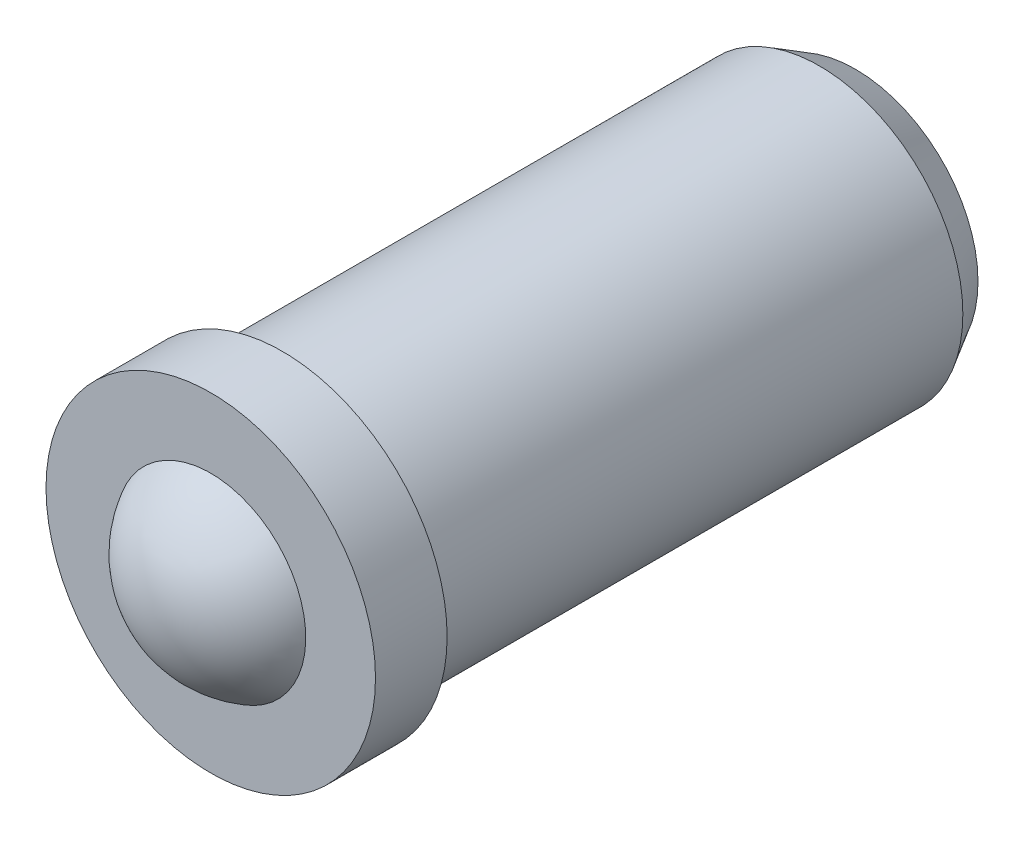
ISO-10303-21;
HEADER;
FILE_DESCRIPTION(('STEP AP214'),'2;1');
FILE_NAME('part.step','',(''),(''),'','','');
FILE_SCHEMA(('AUTOMOTIVE_DESIGN { 1 0 10303 214 1 1 1 1 }'));
ENDSEC;
DATA;
#1=APPLICATION_CONTEXT('core data for automotive mechanical design processes');
#2=APPLICATION_PROTOCOL_DEFINITION('international standard','automotive_design',2000,#1);
#3=PRODUCT_CONTEXT('',#1,'mechanical');
#4=PRODUCT('Part','Part','',(#3));
#5=PRODUCT_RELATED_PRODUCT_CATEGORY('part','',(#4));
#6=PRODUCT_DEFINITION_FORMATION('','',#4);
#7=PRODUCT_DEFINITION_CONTEXT('part definition',#1,'design');
#8=PRODUCT_DEFINITION('design','',#6,#7);
#9=PRODUCT_DEFINITION_SHAPE('','',#8);
#10=(LENGTH_UNIT() NAMED_UNIT(*) SI_UNIT(.MILLI.,.METRE.));
#11=(NAMED_UNIT(*) PLANE_ANGLE_UNIT() SI_UNIT($,.RADIAN.));
#12=(NAMED_UNIT(*) SI_UNIT($,.STERADIAN.) SOLID_ANGLE_UNIT());
#13=UNCERTAINTY_MEASURE_WITH_UNIT(LENGTH_MEASURE(1.E-05),#10,'distance_accuracy_value','');
#14=(GEOMETRIC_REPRESENTATION_CONTEXT(3) GLOBAL_UNCERTAINTY_ASSIGNED_CONTEXT((#13)) GLOBAL_UNIT_ASSIGNED_CONTEXT((#10,
#11,#12)) REPRESENTATION_CONTEXT('',''));
#15=CARTESIAN_POINT('',(0.,0.,0.));
#16=DIRECTION('',(0.,0.,1.));
#17=DIRECTION('',(1.,0.,0.));
#18=AXIS2_PLACEMENT_3D('',#15,#16,#17);
#19=CARTESIAN_POINT('',(0.,0.,0.300000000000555));
#20=DIRECTION('',(0.,0.,-1.));
#21=DIRECTION('',(0.,-1.,0.));
#22=AXIS2_PLACEMENT_3D('',#19,#20,#21);
#23=SPHERICAL_SURFACE('',#22,1.5);
#24=CARTESIAN_POINT('',(0.,0.,1.));
#25=DIRECTION('',(0.,0.,-1.));
#26=DIRECTION('',(-1.,0.,0.));
#27=AXIS2_PLACEMENT_3D('',#24,#25,#26);
#28=CIRCLE('',#27,1.32664991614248);
#29=CARTESIAN_POINT('',(-1.32664991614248,0.,1.));
#30=VERTEX_POINT('',#29);
#31=EDGE_CURVE('E8',#30,#30,#28,.T.);
#32=ORIENTED_EDGE('',*,*,#31,.F.);
#33=EDGE_LOOP('',(#32));
#34=FACE_BOUND('',#33,.T.);
#35=ADVANCED_FACE('F12',(#34),#23,.T.);
#36=CARTESIAN_POINT('',(0.,-2.30000000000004,1.));
#37=DIRECTION('',(0.,0.,-1.));
#38=DIRECTION('',(-1.,0.,0.));
#39=AXIS2_PLACEMENT_3D('',#36,#37,#38);
#40=PLANE('',#39);
#41=CARTESIAN_POINT('',(0.,0.,1.));
#42=DIRECTION('',(0.,0.,-1.));
#43=DIRECTION('',(-1.,0.,0.));
#44=AXIS2_PLACEMENT_3D('',#41,#42,#43);
#45=CIRCLE('',#44,2.30000000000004);
#46=CARTESIAN_POINT('',(-2.30000000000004,0.,1.));
#47=VERTEX_POINT('',#46);
#48=EDGE_CURVE('E18',#47,#47,#45,.T.);
#49=ORIENTED_EDGE('',*,*,#48,.F.);
#50=EDGE_LOOP('',(#49));
#51=FACE_BOUND('',#50,.T.);
#52=ORIENTED_EDGE('',*,*,#31,.T.);
#53=EDGE_LOOP('',(#52));
#54=FACE_BOUND('',#53,.T.);
#55=ADVANCED_FACE('F52',(#51,#54),#40,.F.);
#56=CARTESIAN_POINT('',(0.,0.,-3.99999983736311));
#57=DIRECTION('',(0.,0.,-1.));
#58=DIRECTION('',(-1.,0.,0.));
#59=AXIS2_PLACEMENT_3D('',#56,#57,#58);
#60=CYLINDRICAL_SURFACE('',#59,2.30000000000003);
#61=CARTESIAN_POINT('',(0.,0.,0.));
#62=DIRECTION('',(0.,0.,-1.));
#63=DIRECTION('',(-1.,0.,0.));
#64=AXIS2_PLACEMENT_3D('',#61,#62,#63);
#65=CIRCLE('',#64,2.30000000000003);
#66=CARTESIAN_POINT('',(-2.30000000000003,0.,0.));
#67=VERTEX_POINT('',#66);
#68=EDGE_CURVE('E22',#67,#67,#65,.T.);
#69=ORIENTED_EDGE('',*,*,#68,.F.);
#70=EDGE_LOOP('',(#69));
#71=FACE_BOUND('',#70,.T.);
#72=ORIENTED_EDGE('',*,*,#48,.T.);
#73=EDGE_LOOP('',(#72));
#74=FACE_BOUND('',#73,.T.);
#75=ADVANCED_FACE('F58',(#71,#74),#60,.T.);
#76=CARTESIAN_POINT('',(0.,-2.30000000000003,0.));
#77=DIRECTION('',(0.,0.,1.));
#78=DIRECTION('',(1.,0.,0.));
#79=AXIS2_PLACEMENT_3D('',#76,#77,#78);
#80=PLANE('',#79);
#81=CARTESIAN_POINT('',(0.,0.,0.));
#82=DIRECTION('',(0.,0.,-1.));
#83=DIRECTION('',(-1.,0.,0.));
#84=AXIS2_PLACEMENT_3D('',#81,#82,#83);
#85=CIRCLE('',#84,2.00000000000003);
#86=CARTESIAN_POINT('',(-2.00000000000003,0.,0.));
#87=VERTEX_POINT('',#86);
#88=EDGE_CURVE('E26',#87,#87,#85,.T.);
#89=ORIENTED_EDGE('',*,*,#88,.F.);
#90=EDGE_LOOP('',(#89));
#91=FACE_BOUND('',#90,.T.);
#92=ORIENTED_EDGE('',*,*,#68,.T.);
#93=EDGE_LOOP('',(#92));
#94=FACE_BOUND('',#93,.T.);
#95=ADVANCED_FACE('F64',(#91,#94),#80,.F.);
#96=CARTESIAN_POINT('',(0.,0.,-3.99999983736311));
#97=DIRECTION('',(0.,0.,-1.));
#98=DIRECTION('',(-1.,0.,0.));
#99=AXIS2_PLACEMENT_3D('',#96,#97,#98);
#100=CYLINDRICAL_SURFACE('',#99,2.);
#101=ORIENTED_EDGE('',*,*,#88,.T.);
#102=EDGE_LOOP('',(#101));
#103=FACE_BOUND('',#102,.T.);
#104=CARTESIAN_POINT('',(0.,0.,-7.5));
#105=DIRECTION('',(0.,0.,1.));
#106=DIRECTION('',(1.,0.,0.));
#107=AXIS2_PLACEMENT_3D('',#104,#105,#106);
#108=CIRCLE('',#107,2.);
#109=CARTESIAN_POINT('',(2.,0.,-7.5));
#110=VERTEX_POINT('',#109);
#111=EDGE_CURVE('E31',#110,#110,#108,.T.);
#112=ORIENTED_EDGE('',*,*,#111,.T.);
#113=EDGE_LOOP('',(#112));
#114=FACE_BOUND('',#113,.T.);
#115=ADVANCED_FACE('F48',(#103,#114),#100,.T.);
#116=CARTESIAN_POINT('',(0.,0.,-8.));
#117=DIRECTION('',(0.,0.,1.));
#118=DIRECTION('',(1.,0.,0.));
#119=AXIS2_PLACEMENT_3D('',#116,#117,#118);
#120=CONICAL_SURFACE('',#119,1.71132486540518,0.523598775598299);
#121=ORIENTED_EDGE('',*,*,#111,.F.);
#122=EDGE_LOOP('',(#121));
#123=FACE_BOUND('',#122,.T.);
#124=CARTESIAN_POINT('',(0.,0.,-8.));
#125=DIRECTION('',(0.,0.,1.));
#126=DIRECTION('',(1.,0.,0.));
#127=AXIS2_PLACEMENT_3D('',#124,#125,#126);
#128=CIRCLE('',#127,1.71132486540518);
#129=CARTESIAN_POINT('',(1.71132486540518,0.,-8.));
#130=VERTEX_POINT('',#129);
#131=EDGE_CURVE('E34',#130,#130,#128,.T.);
#132=ORIENTED_EDGE('',*,*,#131,.T.);
#133=EDGE_LOOP('',(#132));
#134=FACE_BOUND('',#133,.T.);
#135=ADVANCED_FACE('F38',(#123,#134),#120,.T.);
#136=CARTESIAN_POINT('',(-1.71132486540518,0.,-8.));
#137=DIRECTION('',(0.,0.,1.));
#138=DIRECTION('',(1.,0.,0.));
#139=AXIS2_PLACEMENT_3D('',#136,#137,#138);
#140=PLANE('',#139);
#141=ORIENTED_EDGE('',*,*,#131,.F.);
#142=EDGE_LOOP('',(#141));
#143=FACE_BOUND('',#142,.T.);
#144=ADVANCED_FACE('F40',(#143),#140,.F.);
#145=CLOSED_SHELL('',(#35,#55,#75,#95,#115,#135,#144));
#146=MANIFOLD_SOLID_BREP('B1',#145);
#147=ADVANCED_BREP_SHAPE_REPRESENTATION('',(#18,#146),#14);
#148=SHAPE_DEFINITION_REPRESENTATION(#9,#147);
ENDSEC;
END-ISO-10303-21;
